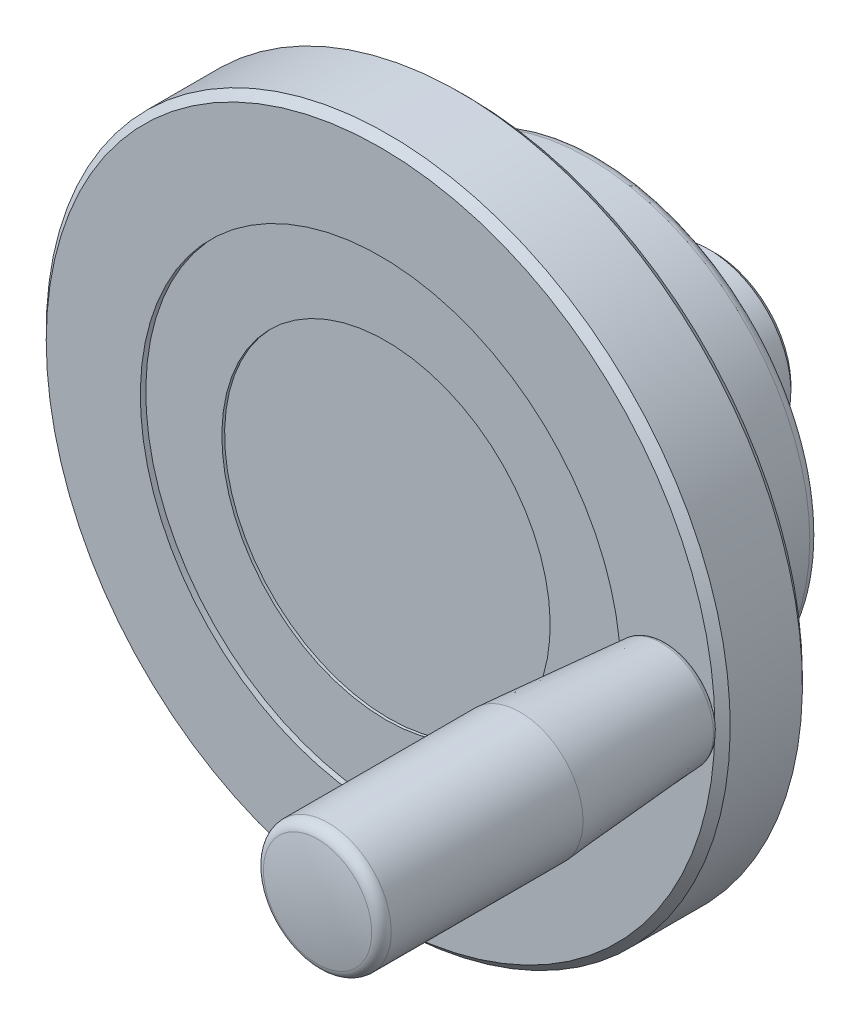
ISO-10303-21;
HEADER;
FILE_DESCRIPTION(('STEP AP214'),'2;1');
FILE_NAME('part.step','',(''),(''),'','','');
FILE_SCHEMA(('AUTOMOTIVE_DESIGN { 1 0 10303 214 1 1 1 1 }'));
ENDSEC;
DATA;
#1=APPLICATION_CONTEXT('core data for automotive mechanical design processes');
#2=APPLICATION_PROTOCOL_DEFINITION('international standard','automotive_design',2000,#1);
#3=PRODUCT_CONTEXT('',#1,'mechanical');
#4=PRODUCT('Part','Part','',(#3));
#5=PRODUCT_RELATED_PRODUCT_CATEGORY('part','',(#4));
#6=PRODUCT_DEFINITION_FORMATION('','',#4);
#7=PRODUCT_DEFINITION_CONTEXT('part definition',#1,'design');
#8=PRODUCT_DEFINITION('design','',#6,#7);
#9=PRODUCT_DEFINITION_SHAPE('','',#8);
#10=(LENGTH_UNIT() NAMED_UNIT(*) SI_UNIT(.MILLI.,.METRE.));
#11=(NAMED_UNIT(*) PLANE_ANGLE_UNIT() SI_UNIT($,.RADIAN.));
#12=(NAMED_UNIT(*) SI_UNIT($,.STERADIAN.) SOLID_ANGLE_UNIT());
#13=UNCERTAINTY_MEASURE_WITH_UNIT(LENGTH_MEASURE(1.E-05),#10,'distance_accuracy_value','');
#14=(GEOMETRIC_REPRESENTATION_CONTEXT(3) GLOBAL_UNCERTAINTY_ASSIGNED_CONTEXT((#13)) GLOBAL_UNIT_ASSIGNED_CONTEXT((#10,
#11,#12)) REPRESENTATION_CONTEXT('',''));
#15=CARTESIAN_POINT('',(0.,0.,0.));
#16=DIRECTION('',(0.,0.,1.));
#17=DIRECTION('',(1.,0.,0.));
#18=AXIS2_PLACEMENT_3D('',#15,#16,#17);
#19=CARTESIAN_POINT('',(-61.1,0.,61.));
#20=DIRECTION('',(0.,0.,-1.));
#21=DIRECTION('',(0.,1.,0.));
#22=AXIS2_PLACEMENT_3D('',#19,#20,#21);
#23=PLANE('',#22);
#24=CARTESIAN_POINT('',(0.,0.,61.));
#25=DIRECTION('',(0.,0.,1.));
#26=DIRECTION('',(0.,-1.,0.));
#27=AXIS2_PLACEMENT_3D('',#24,#25,#26);
#28=CIRCLE('',#27,61.1);
#29=CARTESIAN_POINT('',(0.,-61.1,61.));
#30=VERTEX_POINT('',#29);
#31=EDGE_CURVE('E16',#30,#30,#28,.T.);
#32=ORIENTED_EDGE('',*,*,#31,.T.);
#33=EDGE_LOOP('',(#32));
#34=FACE_BOUND('',#33,.T.);
#35=CARTESIAN_POINT('',(0.,0.,61.));
#36=DIRECTION('',(0.,0.,1.));
#37=DIRECTION('',(0.,-1.,0.));
#38=AXIS2_PLACEMENT_3D('',#35,#36,#37);
#39=CIRCLE('',#38,43.9);
#40=CARTESIAN_POINT('',(0.,-43.9,61.));
#41=VERTEX_POINT('',#40);
#42=EDGE_CURVE('E50',#41,#41,#39,.T.);
#43=ORIENTED_EDGE('',*,*,#42,.F.);
#44=EDGE_LOOP('',(#43));
#45=FACE_BOUND('',#44,.T.);
#46=CARTESIAN_POINT('',(52.5,0.,61.));
#47=DIRECTION('',(0.,0.,1.));
#48=DIRECTION('',(0.,-1.,0.));
#49=AXIS2_PLACEMENT_3D('',#46,#47,#48);
#50=CIRCLE('',#49,6.);
#51=CARTESIAN_POINT('',(52.5,-6.,61.));
#52=VERTEX_POINT('',#51);
#53=EDGE_CURVE('E8',#52,#52,#50,.T.);
#54=ORIENTED_EDGE('',*,*,#53,.F.);
#55=EDGE_LOOP('',(#54));
#56=FACE_BOUND('',#55,.T.);
#57=ADVANCED_FACE('F12',(#34,#45,#56),#23,.F.);
#58=CARTESIAN_POINT('',(0.,0.,0.));
#59=DIRECTION('',(0.,0.,1.));
#60=DIRECTION('',(0.,-1.,0.));
#61=AXIS2_PLACEMENT_3D('',#58,#59,#60);
#62=PLANE('',#61);
#63=CARTESIAN_POINT('',(0.,0.,0.));
#64=DIRECTION('',(0.,0.,1.));
#65=DIRECTION('',(0.,-1.,0.));
#66=AXIS2_PLACEMENT_3D('',#63,#64,#65);
#67=CIRCLE('',#66,14.);
#68=CARTESIAN_POINT('',(0.,-14.,0.));
#69=VERTEX_POINT('',#68);
#70=EDGE_CURVE('E56',#69,#69,#67,.T.);
#71=ORIENTED_EDGE('',*,*,#70,.F.);
#72=EDGE_LOOP('',(#71));
#73=FACE_BOUND('',#72,.T.);
#74=ADVANCED_FACE('F14',(#73),#62,.F.);
#75=CARTESIAN_POINT('',(0.,0.,59.6));
#76=DIRECTION('',(0.,0.,-1.));
#77=DIRECTION('',(0.,1.,0.));
#78=AXIS2_PLACEMENT_3D('',#75,#76,#77);
#79=CONICAL_SURFACE('',#78,62.5,0.785398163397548);
#80=ORIENTED_EDGE('',*,*,#31,.F.);
#81=EDGE_LOOP('',(#80));
#82=FACE_BOUND('',#81,.T.);
#83=CARTESIAN_POINT('',(0.,0.,59.6));
#84=DIRECTION('',(0.,0.,1.));
#85=DIRECTION('',(0.,-1.,0.));
#86=AXIS2_PLACEMENT_3D('',#83,#84,#85);
#87=CIRCLE('',#86,62.5);
#88=CARTESIAN_POINT('',(0.,-62.5,59.6));
#89=VERTEX_POINT('',#88);
#90=EDGE_CURVE('E24',#89,#89,#87,.T.);
#91=ORIENTED_EDGE('',*,*,#90,.T.);
#92=EDGE_LOOP('',(#91));
#93=FACE_BOUND('',#92,.T.);
#94=ADVANCED_FACE('F91',(#82,#93),#79,.T.);
#95=CARTESIAN_POINT('',(0.,0.,90.6490458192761));
#96=DIRECTION('',(0.,0.,1.));
#97=DIRECTION('',(0.,-1.,0.));
#98=AXIS2_PLACEMENT_3D('',#95,#96,#97);
#99=CYLINDRICAL_SURFACE('',#98,62.5);
#100=ORIENTED_EDGE('',*,*,#90,.F.);
#101=EDGE_LOOP('',(#100));
#102=FACE_BOUND('',#101,.T.);
#103=CARTESIAN_POINT('',(0.,0.,46.4));
#104=DIRECTION('',(0.,0.,1.));
#105=DIRECTION('',(0.,-1.,0.));
#106=AXIS2_PLACEMENT_3D('',#103,#104,#105);
#107=CIRCLE('',#106,62.5);
#108=CARTESIAN_POINT('',(0.,-62.5,46.4));
#109=VERTEX_POINT('',#108);
#110=EDGE_CURVE('E86',#109,#109,#107,.T.);
#111=ORIENTED_EDGE('',*,*,#110,.T.);
#112=EDGE_LOOP('',(#111));
#113=FACE_BOUND('',#112,.T.);
#114=ADVANCED_FACE('F93',(#102,#113),#99,.T.);
#115=CARTESIAN_POINT('',(0.,0.,45.));
#116=DIRECTION('',(0.,0.,1.));
#117=DIRECTION('',(0.,-1.,0.));
#118=AXIS2_PLACEMENT_3D('',#115,#116,#117);
#119=CONICAL_SURFACE('',#118,61.1,0.785398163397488);
#120=ORIENTED_EDGE('',*,*,#110,.F.);
#121=EDGE_LOOP('',(#120));
#122=FACE_BOUND('',#121,.T.);
#123=CARTESIAN_POINT('',(0.,0.,45.));
#124=DIRECTION('',(0.,0.,1.));
#125=DIRECTION('',(0.,-1.,0.));
#126=AXIS2_PLACEMENT_3D('',#123,#124,#125);
#127=CIRCLE('',#126,61.1);
#128=CARTESIAN_POINT('',(0.,-61.1,45.));
#129=VERTEX_POINT('',#128);
#130=EDGE_CURVE('E83',#129,#129,#127,.T.);
#131=ORIENTED_EDGE('',*,*,#130,.T.);
#132=EDGE_LOOP('',(#131));
#133=FACE_BOUND('',#132,.T.);
#134=ADVANCED_FACE('F96',(#122,#133),#119,.T.);
#135=CARTESIAN_POINT('',(-61.1,0.,45.));
#136=DIRECTION('',(0.,0.,-1.));
#137=DIRECTION('',(0.,1.,0.));
#138=AXIS2_PLACEMENT_3D('',#135,#136,#137);
#139=PLANE('',#138);
#140=CARTESIAN_POINT('',(0.,0.,45.));
#141=DIRECTION('',(0.,0.,1.));
#142=DIRECTION('',(0.,-1.,0.));
#143=AXIS2_PLACEMENT_3D('',#140,#141,#142);
#144=CIRCLE('',#143,41.507786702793);
#145=CARTESIAN_POINT('',(0.,-41.507786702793,45.));
#146=VERTEX_POINT('',#145);
#147=EDGE_CURVE('E80',#146,#146,#144,.T.);
#148=ORIENTED_EDGE('',*,*,#147,.T.);
#149=EDGE_LOOP('',(#148));
#150=FACE_BOUND('',#149,.T.);
#151=ORIENTED_EDGE('',*,*,#130,.F.);
#152=EDGE_LOOP('',(#151));
#153=FACE_BOUND('',#152,.T.);
#154=ADVANCED_FACE('F102',(#150,#153),#139,.T.);
#155=CARTESIAN_POINT('',(0.,0.,22.8953280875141));
#156=DIRECTION('',(0.,0.,1.));
#157=DIRECTION('',(0.,-1.,0.));
#158=AXIS2_PLACEMENT_3D('',#155,#156,#157);
#159=CONICAL_SURFACE('',#158,40.3493299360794,0.0523598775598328);
#160=ORIENTED_EDGE('',*,*,#147,.F.);
#161=EDGE_LOOP('',(#160));
#162=FACE_BOUND('',#161,.T.);
#163=CARTESIAN_POINT('',(0.,0.,22.8953280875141));
#164=DIRECTION('',(0.,0.,1.));
#165=DIRECTION('',(0.,-1.,0.));
#166=AXIS2_PLACEMENT_3D('',#163,#164,#165);
#167=CIRCLE('',#166,40.3493299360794);
#168=CARTESIAN_POINT('',(0.,-40.3493299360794,22.8953280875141));
#169=VERTEX_POINT('',#168);
#170=EDGE_CURVE('E77',#169,#169,#167,.T.);
#171=ORIENTED_EDGE('',*,*,#170,.T.);
#172=EDGE_LOOP('',(#171));
#173=FACE_BOUND('',#172,.T.);
#174=ADVANCED_FACE('F107',(#162,#173),#159,.T.);
#175=CARTESIAN_POINT('',(0.,0.,23.));
#176=DIRECTION('',(0.,0.,1.));
#177=DIRECTION('',(0.,-1.,0.));
#178=AXIS2_PLACEMENT_3D('',#175,#176,#177);
#179=TOROIDAL_SURFACE('',#178,38.3520708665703,1.99999999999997);
#180=CARTESIAN_POINT('',(0.,0.,21.));
#181=DIRECTION('',(0.,0.,1.));
#182=DIRECTION('',(0.,-1.,0.));
#183=AXIS2_PLACEMENT_3D('',#180,#181,#182);
#184=CIRCLE('',#183,38.3520708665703);
#185=CARTESIAN_POINT('',(0.,-38.3520708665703,21.));
#186=VERTEX_POINT('',#185);
#187=EDGE_CURVE('E74',#186,#186,#184,.T.);
#188=ORIENTED_EDGE('',*,*,#187,.T.);
#189=EDGE_LOOP('',(#188));
#190=FACE_BOUND('',#189,.T.);
#191=ORIENTED_EDGE('',*,*,#170,.F.);
#192=EDGE_LOOP('',(#191));
#193=FACE_BOUND('',#192,.T.);
#194=ADVANCED_FACE('F115',(#190,#193),#179,.T.);
#195=CARTESIAN_POINT('',(-25.75,0.,21.));
#196=DIRECTION('',(0.,0.,1.));
#197=DIRECTION('',(0.,-1.,0.));
#198=AXIS2_PLACEMENT_3D('',#195,#196,#197);
#199=PLANE('',#198);
#200=ORIENTED_EDGE('',*,*,#187,.F.);
#201=EDGE_LOOP('',(#200));
#202=FACE_BOUND('',#201,.T.);
#203=CARTESIAN_POINT('',(0.,0.,21.));
#204=DIRECTION('',(0.,0.,1.));
#205=DIRECTION('',(0.,-1.,0.));
#206=AXIS2_PLACEMENT_3D('',#203,#204,#205);
#207=CIRCLE('',#206,25.75);
#208=CARTESIAN_POINT('',(0.,-25.75,21.));
#209=VERTEX_POINT('',#208);
#210=EDGE_CURVE('E71',#209,#209,#207,.T.);
#211=ORIENTED_EDGE('',*,*,#210,.T.);
#212=EDGE_LOOP('',(#211));
#213=FACE_BOUND('',#212,.T.);
#214=ADVANCED_FACE('F179',(#202,#213),#199,.F.);
#215=CARTESIAN_POINT('',(0.,0.,19.));
#216=DIRECTION('',(0.,0.,1.));
#217=DIRECTION('',(0.,-1.,0.));
#218=AXIS2_PLACEMENT_3D('',#215,#216,#217);
#219=TOROIDAL_SURFACE('',#218,25.75,2.);
#220=ORIENTED_EDGE('',*,*,#210,.F.);
#221=EDGE_LOOP('',(#220));
#222=FACE_BOUND('',#221,.T.);
#223=CARTESIAN_POINT('',(0.,0.,19.));
#224=DIRECTION('',(0.,0.,1.));
#225=DIRECTION('',(0.,-1.,0.));
#226=AXIS2_PLACEMENT_3D('',#223,#224,#225);
#227=CIRCLE('',#226,23.75);
#228=CARTESIAN_POINT('',(0.,-23.75,19.));
#229=VERTEX_POINT('',#228);
#230=EDGE_CURVE('E68',#229,#229,#227,.T.);
#231=ORIENTED_EDGE('',*,*,#230,.T.);
#232=EDGE_LOOP('',(#231));
#233=FACE_BOUND('',#232,.T.);
#234=ADVANCED_FACE('F187',(#222,#233),#219,.F.);
#235=CARTESIAN_POINT('',(0.,0.,90.6490458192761));
#236=DIRECTION('',(0.,0.,1.));
#237=DIRECTION('',(0.,-1.,0.));
#238=AXIS2_PLACEMENT_3D('',#235,#236,#237);
#239=CYLINDRICAL_SURFACE('',#238,23.75);
#240=CARTESIAN_POINT('',(0.,0.,12.));
#241=DIRECTION('',(0.,0.,1.));
#242=DIRECTION('',(0.,-1.,0.));
#243=AXIS2_PLACEMENT_3D('',#240,#241,#242);
#244=CIRCLE('',#243,23.75);
#245=CARTESIAN_POINT('',(0.,-23.75,12.));
#246=VERTEX_POINT('',#245);
#247=EDGE_CURVE('E65',#246,#246,#244,.T.);
#248=ORIENTED_EDGE('',*,*,#247,.T.);
#249=EDGE_LOOP('',(#248));
#250=FACE_BOUND('',#249,.T.);
#251=ORIENTED_EDGE('',*,*,#230,.F.);
#252=EDGE_LOOP('',(#251));
#253=FACE_BOUND('',#252,.T.);
#254=ADVANCED_FACE('F196',(#250,#253),#239,.T.);
#255=CARTESIAN_POINT('',(-15.,0.,12.));
#256=DIRECTION('',(0.,0.,1.));
#257=DIRECTION('',(0.,-1.,0.));
#258=AXIS2_PLACEMENT_3D('',#255,#256,#257);
#259=PLANE('',#258);
#260=ORIENTED_EDGE('',*,*,#247,.F.);
#261=EDGE_LOOP('',(#260));
#262=FACE_BOUND('',#261,.T.);
#263=CARTESIAN_POINT('',(0.,0.,12.));
#264=DIRECTION('',(0.,0.,1.));
#265=DIRECTION('',(0.,-1.,0.));
#266=AXIS2_PLACEMENT_3D('',#263,#264,#265);
#267=CIRCLE('',#266,15.);
#268=CARTESIAN_POINT('',(0.,-15.,12.));
#269=VERTEX_POINT('',#268);
#270=EDGE_CURVE('E62',#269,#269,#267,.T.);
#271=ORIENTED_EDGE('',*,*,#270,.T.);
#272=EDGE_LOOP('',(#271));
#273=FACE_BOUND('',#272,.T.);
#274=ADVANCED_FACE('F205',(#262,#273),#259,.F.);
#275=CARTESIAN_POINT('',(0.,0.,90.6490458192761));
#276=DIRECTION('',(0.,0.,1.));
#277=DIRECTION('',(0.,-1.,0.));
#278=AXIS2_PLACEMENT_3D('',#275,#276,#277);
#279=CYLINDRICAL_SURFACE('',#278,15.);
#280=CARTESIAN_POINT('',(0.,0.,1.));
#281=DIRECTION('',(0.,0.,1.));
#282=DIRECTION('',(0.,-1.,0.));
#283=AXIS2_PLACEMENT_3D('',#280,#281,#282);
#284=CIRCLE('',#283,15.);
#285=CARTESIAN_POINT('',(0.,-15.,1.));
#286=VERTEX_POINT('',#285);
#287=EDGE_CURVE('E59',#286,#286,#284,.T.);
#288=ORIENTED_EDGE('',*,*,#287,.T.);
#289=EDGE_LOOP('',(#288));
#290=FACE_BOUND('',#289,.T.);
#291=ORIENTED_EDGE('',*,*,#270,.F.);
#292=EDGE_LOOP('',(#291));
#293=FACE_BOUND('',#292,.T.);
#294=ADVANCED_FACE('F214',(#290,#293),#279,.T.);
#295=CARTESIAN_POINT('',(0.,0.,0.));
#296=DIRECTION('',(0.,0.,1.));
#297=DIRECTION('',(0.,-1.,0.));
#298=AXIS2_PLACEMENT_3D('',#295,#296,#297);
#299=CONICAL_SURFACE('',#298,14.,0.785398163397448);
#300=ORIENTED_EDGE('',*,*,#287,.F.);
#301=EDGE_LOOP('',(#300));
#302=FACE_BOUND('',#301,.T.);
#303=ORIENTED_EDGE('',*,*,#70,.T.);
#304=EDGE_LOOP('',(#303));
#305=FACE_BOUND('',#304,.T.);
#306=ADVANCED_FACE('F223',(#302,#305),#299,.T.);
#307=CARTESIAN_POINT('',(0.,0.,60.));
#308=DIRECTION('',(0.,0.,1.));
#309=DIRECTION('',(0.,-1.,0.));
#310=AXIS2_PLACEMENT_3D('',#307,#308,#309);
#311=CYLINDRICAL_SURFACE('',#310,43.9);
#312=CARTESIAN_POINT('',(0.,0.,60.));
#313=DIRECTION('',(0.,0.,1.));
#314=DIRECTION('',(0.,-1.,0.));
#315=AXIS2_PLACEMENT_3D('',#312,#313,#314);
#316=CIRCLE('',#315,43.9);
#317=CARTESIAN_POINT('',(0.,-43.9,60.));
#318=VERTEX_POINT('',#317);
#319=EDGE_CURVE('E53',#318,#318,#316,.T.);
#320=ORIENTED_EDGE('',*,*,#319,.F.);
#321=EDGE_LOOP('',(#320));
#322=FACE_BOUND('',#321,.T.);
#323=ORIENTED_EDGE('',*,*,#42,.T.);
#324=EDGE_LOOP('',(#323));
#325=FACE_BOUND('',#324,.T.);
#326=ADVANCED_FACE('F232',(#322,#325),#311,.F.);
#327=CARTESIAN_POINT('',(0.,0.,60.));
#328=DIRECTION('',(0.,0.,1.));
#329=DIRECTION('',(0.,-1.,0.));
#330=AXIS2_PLACEMENT_3D('',#327,#328,#329);
#331=PLANE('',#330);
#332=CARTESIAN_POINT('',(0.,0.,60.));
#333=DIRECTION('',(0.,0.,1.));
#334=DIRECTION('',(0.,-1.,0.));
#335=AXIS2_PLACEMENT_3D('',#332,#333,#334);
#336=CIRCLE('',#335,30.);
#337=CARTESIAN_POINT('',(0.,-30.,60.));
#338=VERTEX_POINT('',#337);
#339=EDGE_CURVE('E47',#338,#338,#336,.T.);
#340=ORIENTED_EDGE('',*,*,#339,.F.);
#341=EDGE_LOOP('',(#340));
#342=FACE_BOUND('',#341,.T.);
#343=ORIENTED_EDGE('',*,*,#319,.T.);
#344=EDGE_LOOP('',(#343));
#345=FACE_BOUND('',#344,.T.);
#346=ADVANCED_FACE('F235',(#342,#345),#331,.T.);
#347=CARTESIAN_POINT('',(0.,0.,59.5));
#348=DIRECTION('',(0.,0.,1.));
#349=DIRECTION('',(0.,-1.,0.));
#350=AXIS2_PLACEMENT_3D('',#347,#348,#349);
#351=CYLINDRICAL_SURFACE('',#350,30.);
#352=ORIENTED_EDGE('',*,*,#339,.T.);
#353=EDGE_LOOP('',(#352));
#354=FACE_BOUND('',#353,.T.);
#355=CARTESIAN_POINT('',(0.,0.,59.5));
#356=DIRECTION('',(0.,0.,1.));
#357=DIRECTION('',(0.,-1.,0.));
#358=AXIS2_PLACEMENT_3D('',#355,#356,#357);
#359=CIRCLE('',#358,30.);
#360=CARTESIAN_POINT('',(0.,-30.,59.5));
#361=VERTEX_POINT('',#360);
#362=EDGE_CURVE('E44',#361,#361,#359,.T.);
#363=ORIENTED_EDGE('',*,*,#362,.F.);
#364=EDGE_LOOP('',(#363));
#365=FACE_BOUND('',#364,.T.);
#366=ADVANCED_FACE('F251',(#354,#365),#351,.F.);
#367=CARTESIAN_POINT('',(0.,0.,59.5));
#368=DIRECTION('',(0.,0.,1.));
#369=DIRECTION('',(0.,-1.,0.));
#370=AXIS2_PLACEMENT_3D('',#367,#368,#369);
#371=PLANE('',#370);
#372=ORIENTED_EDGE('',*,*,#362,.T.);
#373=EDGE_LOOP('',(#372));
#374=FACE_BOUND('',#373,.T.);
#375=ADVANCED_FACE('F244',(#374),#371,.T.);
#376=CARTESIAN_POINT('',(52.5,0.,76.));
#377=DIRECTION('',(0.,-1.,0.));
#378=DIRECTION('',(0.,0.,-1.));
#379=AXIS2_PLACEMENT_3D('',#376,#377,#378);
#380=SPHERICAL_SURFACE('',#379,50.);
#381=CARTESIAN_POINT('',(52.5,0.,76.));
#382=DIRECTION('',(0.,0.,1.));
#383=DIRECTION('',(0.,-1.,0.));
#384=AXIS2_PLACEMENT_3D('',#381,#382,#383);
#385=SPHERICAL_SURFACE('',#384,50.);
#386=CARTESIAN_POINT('',(52.5,0.,125.010942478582));
#387=DIRECTION('',(0.,0.,1.));
#388=DIRECTION('',(0.,-1.,0.));
#389=AXIS2_PLACEMENT_3D('',#386,#387,#388);
#390=CIRCLE('',#389,9.89583333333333);
#391=CARTESIAN_POINT('',(52.5,-9.89583333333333,125.010942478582));
#392=VERTEX_POINT('',#391);
#393=EDGE_CURVE('E41',#392,#392,#390,.T.);
#394=ORIENTED_EDGE('',*,*,#393,.T.);
#395=EDGE_LOOP('',(#394));
#396=FACE_BOUND('',#395,.T.);
#397=ADVANCED_FACE('F262',(#396),#385,.T.);
#398=CARTESIAN_POINT('',(52.5,0.,123.050504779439));
#399=DIRECTION('',(0.,0.,1.));
#400=DIRECTION('',(0.,-1.,0.));
#401=AXIS2_PLACEMENT_3D('',#398,#399,#400);
#402=TOROIDAL_SURFACE('',#401,9.5,2.00000000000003);
#403=CARTESIAN_POINT('',(52.5,0.,123.050504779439));
#404=DIRECTION('',(0.,0.,1.));
#405=DIRECTION('',(0.,-1.,0.));
#406=AXIS2_PLACEMENT_3D('',#403,#404,#405);
#407=CIRCLE('',#406,11.5);
#408=CARTESIAN_POINT('',(52.5,-11.5,123.050504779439));
#409=VERTEX_POINT('',#408);
#410=EDGE_CURVE('E38',#409,#409,#407,.T.);
#411=ORIENTED_EDGE('',*,*,#410,.T.);
#412=EDGE_LOOP('',(#411));
#413=FACE_BOUND('',#412,.T.);
#414=ORIENTED_EDGE('',*,*,#393,.F.);
#415=EDGE_LOOP('',(#414));
#416=FACE_BOUND('',#415,.T.);
#417=ADVANCED_FACE('F277',(#413,#416),#402,.T.);
#418=CARTESIAN_POINT('',(52.5,0.,146.165949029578));
#419=DIRECTION('',(0.,0.,1.));
#420=DIRECTION('',(0.,-1.,0.));
#421=AXIS2_PLACEMENT_3D('',#418,#419,#420);
#422=CYLINDRICAL_SURFACE('',#421,11.5);
#423=CARTESIAN_POINT('',(52.5,0.,88.));
#424=DIRECTION('',(0.,0.,1.));
#425=DIRECTION('',(0.,-1.,0.));
#426=AXIS2_PLACEMENT_3D('',#423,#424,#425);
#427=CIRCLE('',#426,11.5);
#428=CARTESIAN_POINT('',(52.5,-11.5,88.));
#429=VERTEX_POINT('',#428);
#430=EDGE_CURVE('E35',#429,#429,#427,.T.);
#431=ORIENTED_EDGE('',*,*,#430,.T.);
#432=EDGE_LOOP('',(#431));
#433=FACE_BOUND('',#432,.T.);
#434=ORIENTED_EDGE('',*,*,#410,.F.);
#435=EDGE_LOOP('',(#434));
#436=FACE_BOUND('',#435,.T.);
#437=ADVANCED_FACE('F286',(#433,#436),#422,.T.);
#438=CARTESIAN_POINT('',(52.5,0.,62.2253029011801));
#439=DIRECTION('',(0.,0.,1.));
#440=DIRECTION('',(0.,-1.,0.));
#441=AXIS2_PLACEMENT_3D('',#438,#439,#440);
#442=CONICAL_SURFACE('',#441,9.56931107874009,0.0747667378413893);
#443=ORIENTED_EDGE('',*,*,#430,.F.);
#444=EDGE_LOOP('',(#443));
#445=FACE_BOUND('',#444,.T.);
#446=CARTESIAN_POINT('',(52.5,0.,62.2253029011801));
#447=DIRECTION('',(0.,0.,1.));
#448=DIRECTION('',(0.,-1.,0.));
#449=AXIS2_PLACEMENT_3D('',#446,#447,#448);
#450=CIRCLE('',#449,9.56931107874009);
#451=CARTESIAN_POINT('',(52.5,-9.56931107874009,62.2253029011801));
#452=VERTEX_POINT('',#451);
#453=EDGE_CURVE('E32',#452,#452,#450,.T.);
#454=ORIENTED_EDGE('',*,*,#453,.T.);
#455=EDGE_LOOP('',(#454));
#456=FACE_BOUND('',#455,.T.);
#457=ADVANCED_FACE('F295',(#445,#456),#442,.T.);
#458=CARTESIAN_POINT('',(52.5,0.,62.3));
#459=DIRECTION('',(0.,0.,1.));
#460=DIRECTION('',(0.,-1.,0.));
#461=AXIS2_PLACEMENT_3D('',#458,#459,#460);
#462=TOROIDAL_SURFACE('',#461,8.57210480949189,1.00000000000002);
#463=CARTESIAN_POINT('',(52.5,0.,61.3));
#464=DIRECTION('',(0.,0.,1.));
#465=DIRECTION('',(0.,-1.,0.));
#466=AXIS2_PLACEMENT_3D('',#463,#464,#465);
#467=CIRCLE('',#466,8.57210480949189);
#468=CARTESIAN_POINT('',(52.5,-8.57210480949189,61.3));
#469=VERTEX_POINT('',#468);
#470=EDGE_CURVE('E29',#469,#469,#467,.T.);
#471=ORIENTED_EDGE('',*,*,#470,.T.);
#472=EDGE_LOOP('',(#471));
#473=FACE_BOUND('',#472,.T.);
#474=ORIENTED_EDGE('',*,*,#453,.F.);
#475=EDGE_LOOP('',(#474));
#476=FACE_BOUND('',#475,.T.);
#477=ADVANCED_FACE('F304',(#473,#476),#462,.T.);
#478=CARTESIAN_POINT('',(46.5,0.,61.3));
#479=DIRECTION('',(0.,0.,1.));
#480=DIRECTION('',(0.,-1.,0.));
#481=AXIS2_PLACEMENT_3D('',#478,#479,#480);
#482=PLANE('',#481);
#483=ORIENTED_EDGE('',*,*,#470,.F.);
#484=EDGE_LOOP('',(#483));
#485=FACE_BOUND('',#484,.T.);
#486=CARTESIAN_POINT('',(52.5,0.,61.3));
#487=DIRECTION('',(0.,0.,1.));
#488=DIRECTION('',(0.,-1.,0.));
#489=AXIS2_PLACEMENT_3D('',#486,#487,#488);
#490=CIRCLE('',#489,6.);
#491=CARTESIAN_POINT('',(52.5,-6.,61.3));
#492=VERTEX_POINT('',#491);
#493=EDGE_CURVE('E26',#492,#492,#490,.T.);
#494=ORIENTED_EDGE('',*,*,#493,.T.);
#495=EDGE_LOOP('',(#494));
#496=FACE_BOUND('',#495,.T.);
#497=ADVANCED_FACE('F313',(#485,#496),#482,.F.);
#498=CARTESIAN_POINT('',(52.5,0.,146.165949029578));
#499=DIRECTION('',(0.,0.,1.));
#500=DIRECTION('',(0.,-1.,0.));
#501=AXIS2_PLACEMENT_3D('',#498,#499,#500);
#502=CYLINDRICAL_SURFACE('',#501,6.);
#503=ORIENTED_EDGE('',*,*,#493,.F.);
#504=EDGE_LOOP('',(#503));
#505=FACE_BOUND('',#504,.T.);
#506=ORIENTED_EDGE('',*,*,#53,.T.);
#507=EDGE_LOOP('',(#506));
#508=FACE_BOUND('',#507,.T.);
#509=ADVANCED_FACE('F322',(#505,#508),#502,.T.);
#510=CLOSED_SHELL('',(#57,#74,#94,#114,#134,#154,#174,#194,#214,#234,#254,#274,#294,#306,#326,
#346,#366,#375,#397,#417,#437,#457,#477,#497,#509));
#511=MANIFOLD_SOLID_BREP('B1',#510);
#512=ADVANCED_BREP_SHAPE_REPRESENTATION('',(#18,#511),#14);
#513=SHAPE_DEFINITION_REPRESENTATION(#9,#512);
ENDSEC;
END-ISO-10303-21;
